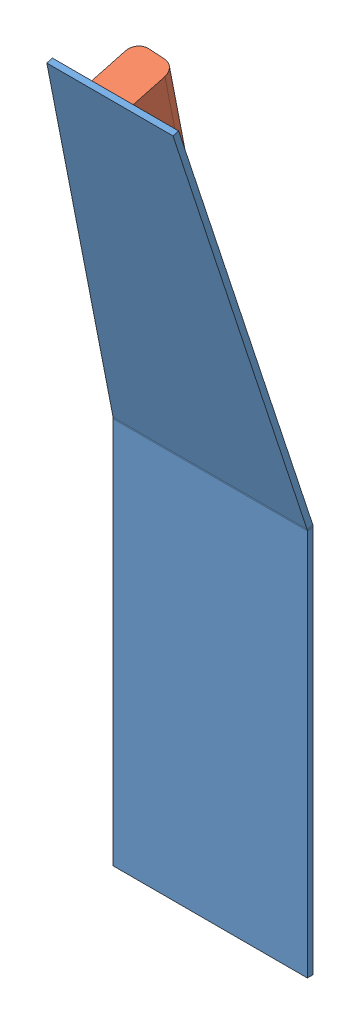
SolidWorks assembly Gehrung.SLDASM, configuration Standard (file format 3400). Lengths in mm.
Overall size (51.19 196.79 50.37).
3 component instances, 2 part files, 4 mates.
Components (placement in the parent):
- Blech-1: Blech.SLDPRT [Standard] at (-26.6889 -66.1648 -13.6784) size (50.01 196.79 27.36)
- Leiste-1: Leiste.SLDPRT [Standard] at (-27.871 20.9818 -17.1494) x (0.996195 -0.084186 -0.022558) z (0.087156 0.96225 0.257834) size (10 20 100)
- Leiste-2: Leiste.SLDPRT [Standard] at (-26.6889 -49.4392 -13.6784) x (1 0 0) z (0 1 0) size (10 20 100)
Mates (geometry in assembly coordinates):
- Deckungsgleich1: coincident aligned: plane of Blech-1 through (-26.6889 33.6444 -12.2035) normal (-0.996195 0.084186 0.022558); plane of Leiste-1 through (-19.1554 117.2068 8.6341) normal (-0.996195 0.084186 0.022558)
- Deckungsgleich2: coincident anti-aligned: plane of Blech-1 through (-26.6889 130.6252 12.2295) normal (0 0.258819 -0.965926); plane of Leiste-1 through (-19.1554 117.2068 8.6341) normal (0 -0.258819 0.965926)
- Deckungsgleich3: coincident anti-aligned: plane of Blech-1 through (-26.6889 133.8352 -13.6784) normal (0 0 -1); plane of Leiste-2 through (-26.6889 50.5608 -13.6784) normal (0 0 1)
- Deckungsgleich4: coincident aligned: plane of Blech-1 through (-26.6889 -66.1648 -12.1784) normal (-1 0 0); plane of Leiste-2 through (-26.6889 50.5608 -13.6784) normal (-1 0 0)
